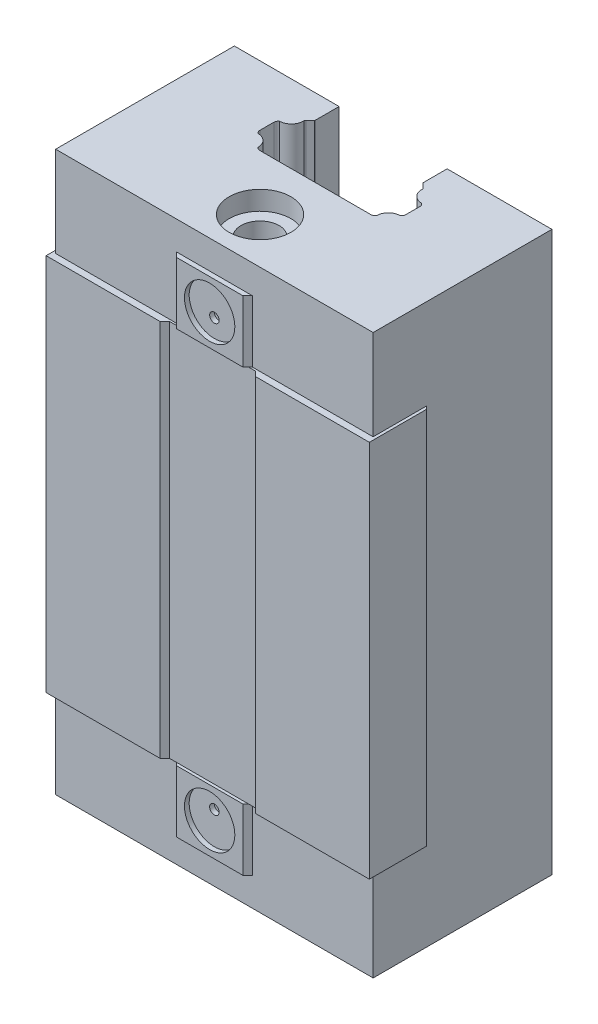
from build123d import *
from build123d.topology import SkipClean

# Parameters (mm, degrees)
SKETCH_1_W                     = 34
SKETCH_1_H                     = 39.8
EXTRUDE_1_DEPTH                = 19.5
SKETCH_2_W                     = 0.3
SKETCH_2_H                     = 13.5
CUT_EXTRUDE_1_DEPTH            = 77.88979114
SKETCH_3_W                     = 33.4
SKETCH_3_H                     = 18.8
EXTRUDE_2_DEPTH                = 8.5
SKETCH_4_W                     = 33.4
SKETCH_4_H                     = 18.8
EXTRUDE_3_DEPTH                = 8.5
SKETCH_5_W                     = 9
SKETCH_5_H                     = 0.5
CUT_EXTRUDE_2_DEPTH            = 82.614275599
SKETCH_6_W                     = 8
SKETCH_6_H                     = 6.5
EXTRUDE_4_DEPTH                = 0.2
SKETCH_7_W                     = 8
SKETCH_7_H                     = 6.5
EXTRUDE_5_DEPTH                = 0.3
SKETCH_8_W                     = 8
SKETCH_8_H                     = 6.5
EXTRUDE_6_DEPTH                = 0.2
SKETCH_9_W                     = 8
SKETCH_9_H                     = 6.5
EXTRUDE_7_DEPTH                = 0.3
CUT_EXTRUDE_3_DEPTH            = 87.915130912
DRAFT_1_ANGLE                  = 45
DRAFT_2_ANGLE                  = 45
DRAFT_3_ANGLE                  = 45
DRAFT_4_ANGLE                  = 45
HOLE_WIZARD_M3_5_1_D           = 4
HOLE_WIZARD_M3_5_1_DEPTH       = 5.4
HOLE_WIZARD_M3_5_1_CBORE_D     = 6.5
HOLE_WIZARD_M3_5_1_CBORE_DEPTH = 1
HOLE_WIZARD_M3_5_2_D           = 4
HOLE_WIZARD_M3_5_2_DEPTH       = 5.4
HOLE_WIZARD_M3_5_2_CBORE_D     = 6.5
HOLE_WIZARD_M3_5_2_CBORE_DEPTH = 1
HOLE_WIZARD_5_3_5_3_1_D        = 5.3
HOLE_WIZARD_5_3_5_3_1_DEPTH    = 0.5
HOLE_WIZARD_1_0_1_1_D          = 1
HOLE_WIZARD_1_0_1_1_DEPTH      = 0.5
FILLET_1_R                     = 0.12
SKETCH_25_W                    = 13.5
SKETCH_25_H                    = 39.8
CUT_EXTRUDE_4_DEPTH            = 0.3
EXTRUDE_START                  = 1
SKETCH_26_R                    = 3.25
EXTRUDE_8_DEPTH                = 1
SKETCH_27_R                    = 3.25
EXTRUDE_9_DEPTH                = 1


with BuildPart() as part:
    # Sketch 1 → Extrude 1 (new body)
    with BuildSketch(Plane(origin=(0, 0, 2.5), x_dir=(-1, 0, 0), z_dir=(0, 0, -1))):
        with Locations((-44.999999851, 136)):
            Rectangle(SKETCH_1_W, SKETCH_1_H)
    extrude(amount=-EXTRUDE_1_DEPTH)

    # Sketch 2 → Cut-Extrude 1 (cut, through all)
    with BuildSketch(Plane(origin=(0, 155.9, 0), x_dir=(-1, 0, 0), z_dir=(0, 1, 0))):
        with Locations((-61.849999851, 9.25)):
            Rectangle(SKETCH_2_W, SKETCH_2_H)
    extrude(amount=-CUT_EXTRUDE_1_DEPTH, mode=Mode.SUBTRACT)

    # Sketch 3 → Extrude 2 (add)
    with BuildSketch(Plane(origin=(0, 155.9, 0), x_dir=(-1, 0, 0), z_dir=(0, 1, 0))):
        with Locations((-44.999999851, 11.9)):
            Rectangle(SKETCH_3_W, SKETCH_3_H)
    extrude(amount=EXTRUDE_2_DEPTH)

    # Sketch 4 → Extrude 3 (add)
    with BuildSketch(Plane.XZ.offset(-116.1)):
        with Locations((44.999999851, 11.9)):
            Rectangle(SKETCH_4_W, SKETCH_4_H)
    extrude(amount=EXTRUDE_3_DEPTH)

    # Sketch 5 → Cut-Extrude 2 (cut, through all)
    with BuildSketch(Plane(origin=(0, 155.9, 0), x_dir=(-1, 0, 0), z_dir=(0, 1, 0))):
        with Locations((-44.999999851, 21.75)):
            Rectangle(SKETCH_5_W, SKETCH_5_H)
    extrude(amount=-CUT_EXTRUDE_2_DEPTH, mode=Mode.SUBTRACT)

    # Sketch 6 → Extrude 4 (add)
    with BuildSketch(Plane.XY.offset(21.3)):
        with Locations((44.999999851, 159.15)):
            Rectangle(SKETCH_6_W, SKETCH_6_H)
    extrude(amount=EXTRUDE_4_DEPTH)

    # Sketch 7 → Extrude 5 (add)
    with BuildSketch(Plane.XY.offset(21.5)):
        with Locations((44.999999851, 159.15)):
            Rectangle(SKETCH_7_W, SKETCH_7_H)
    extrude(amount=EXTRUDE_5_DEPTH)

    # Sketch 8 → Extrude 6 (add)
    with BuildSketch(Plane.XY.offset(21.3)):
        with Locations((44.999999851, 112.85)):
            Rectangle(SKETCH_8_W, SKETCH_8_H)
    extrude(amount=EXTRUDE_6_DEPTH)

    # Sketch 9 → Extrude 7 (add)
    with BuildSketch(Plane.XY.offset(21.5)):
        with Locations((44.999999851, 112.85)):
            Rectangle(SKETCH_9_W, SKETCH_9_H)
    extrude(amount=EXTRUDE_7_DEPTH)

    # Sketch 10 → Cut-Extrude 3 (cut, through all)
    with BuildSketch(Plane.XZ.offset(-107.6)):
        with BuildLine():
            Line((50.679999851, 2.5), (50.679999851, 5.031660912))
            Line((50.679999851, 5.031660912), (51.146433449, 5.498096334))
            ThreePointArc((51.146433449, 5.498096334), (51.194720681, 5.554506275), (51.233729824, 5.617688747))
            ThreePointArc((51.233729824, 5.617688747), (51.555700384, 6.562594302), (52.466836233, 6.97044601))
            ThreePointArc((52.466836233, 6.97044601), (52.623368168, 7.143258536), (52.679999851, 7.369442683))
            Line((52.679999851, 7.369442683), (52.679999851, 8.830565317))
            ThreePointArc((52.679999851, 8.830565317), (52.623368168, 9.056749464), (52.466836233, 9.22956199))
            ThreePointArc((52.466836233, 9.22956199), (51.595610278, 9.595614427), (51.229557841, 10.466840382))
            ThreePointArc((51.229557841, 10.466840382), (51.056745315, 10.623372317), (50.830561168, 10.680004))
            Line((50.830561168, 10.680004), (39.169438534, 10.680004))
            ThreePointArc((39.169438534, 10.680004), (38.943254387, 10.623372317), (38.770441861, 10.466840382))
            ThreePointArc((38.770441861, 10.466840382), (38.404389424, 9.595614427), (37.533163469, 9.22956199))
            ThreePointArc((37.533163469, 9.22956199), (37.376631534, 9.056749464), (37.319999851, 8.830565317))
            Line((37.319999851, 8.830565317), (37.319999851, 7.369442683))
            ThreePointArc((37.319999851, 7.369442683), (37.376631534, 7.143258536), (37.533163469, 6.97044601))
            ThreePointArc((37.533163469, 6.97044601), (38.444299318, 6.562594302), (38.766269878, 5.617688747))
            ThreePointArc((38.766269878, 5.617688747), (38.805279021, 5.554506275), (38.853566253, 5.498096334))
            Line((38.853566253, 5.498096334), (39.319999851, 5.031660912))
            Line((39.319999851, 5.031660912), (39.319999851, 2.5))
            Line((39.319999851, 2.5), (50.679999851, 2.5))
        make_face()
    extrude(amount=-CUT_EXTRUDE_3_DEPTH, mode=Mode.SUBTRACT)

    # Draft 1
    draft_1_faces = [part.faces().sort_by_distance(p)[0] for p in [
        (61.849999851, 136, 16),
    ]]
    draft(draft_1_faces, Plane(origin=(61.999999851, 155.9, 22), x_dir=(0, 0, 1), z_dir=(1, 0, 0)), DRAFT_1_ANGLE)

    # Draft 2
    draft_2_faces = [part.faces().sort_by_distance(p)[0] for p in [
        (48.999999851, 112.85, 21.55),
        (40.999999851, 112.85, 21.55),
    ]]
    draft(draft_2_faces, Plane(origin=(28.299999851, 107.6, 21.3), x_dir=(1, 0, 0), z_dir=(0, 0, 1)), DRAFT_2_ANGLE)

    # Draft 3
    draft_3_faces = [part.faces().sort_by_distance(p)[0] for p in [
        (48.999999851, 159.15, 21.55),
        (40.999999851, 159.15, 21.55),
    ]]
    draft(draft_3_faces, Plane(origin=(61.699999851, 164.4, 21.3), x_dir=(1, 0, 0), z_dir=(0, 0, 1)), DRAFT_3_ANGLE)

    # Draft 4
    draft_4_faces = [part.faces().sort_by_distance(p)[0] for p in [
        (40.499999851, 136, 21.75),
        (49.499999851, 136, 21.75),
    ]]
    draft(draft_4_faces, Plane(origin=(49.499999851, 107.599975, 21.5), x_dir=(1, 0, 0), z_dir=(0, 0, 1)), DRAFT_4_ANGLE)

    # Hole Wizard M3.5 _1
    with Locations(Plane(origin=(0, 107.6, 0), x_dir=(-1, 0, 0), z_dir=(0, -1, 0))):
        with Locations((-44.999999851, -16.5)):
            CounterBoreHole(HOLE_WIZARD_M3_5_1_D / 2, HOLE_WIZARD_M3_5_1_CBORE_D / 2, HOLE_WIZARD_M3_5_1_CBORE_DEPTH, depth=HOLE_WIZARD_M3_5_1_DEPTH)

    # Hole Wizard M3.5 _2
    with Locations(Plane(origin=(0, 164.4, 0), x_dir=(1, 0, 0), z_dir=(0, 1, 0))):
        with Locations((44.999999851, -16.5)):
            CounterBoreHole(HOLE_WIZARD_M3_5_2_D / 2, HOLE_WIZARD_M3_5_2_CBORE_D / 2, HOLE_WIZARD_M3_5_2_CBORE_DEPTH, depth=HOLE_WIZARD_M3_5_2_DEPTH)

    # Hole Wizard 5.3 _5.3_ _1
    with Locations(Plane.XY.offset(21.8)):
        with Locations((44.999999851, 159.15), (44.999999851, 112.85)):
            Hole(HOLE_WIZARD_5_3_5_3_1_D / 2, depth=HOLE_WIZARD_5_3_5_3_1_DEPTH)

    # Hole Wizard 1.0 _1_ _1
    with Locations(Plane.XY.offset(21.3)):
        with Locations((44.999999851, 158.4), (44.999999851, 113.6)):
            Hole(HOLE_WIZARD_1_0_1_1_D / 2, depth=HOLE_WIZARD_1_0_1_1_DEPTH)

    # Fillet 1
    fillet_1_edges = [part.edges().sort_by_distance(p)[0] for p in [
        (39.319999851, 136, 5.031660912),
        (50.679999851, 136, 5.031660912),
    ]]
    fillet(fillet_1_edges, radius=FILLET_1_R)

    # Sketch 25 → Cut-Extrude 4 (cut)
    with BuildSketch(Plane.ZY.offset(-27.999999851)):
        with Locations((9.25, 136)):
            Rectangle(SKETCH_25_W, SKETCH_25_H)
    extrude(amount=-CUT_EXTRUDE_4_DEPTH, mode=Mode.SUBTRACT)

    # Sketch 26 → Extrude 8 (add)
    with BuildSketch(Plane.XZ.offset(-107.6).offset(EXTRUDE_START)):
        with BuildLine():
            Line((39.319999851, 2.5), (39.319999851, 4.981955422))
            ThreePointArc((39.319999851, 4.981955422), (39.31086544, 5.027877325), (39.284852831, 5.066808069))
            Line((39.284852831, 5.066808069), (38.853566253, 5.498096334))
            ThreePointArc((38.853566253, 5.498096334), (38.805279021, 5.554506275), (38.766269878, 5.617688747))
            ThreePointArc((38.766269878, 5.617688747), (38.444299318, 6.562594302), (37.533163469, 6.97044601))
            ThreePointArc((37.533163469, 6.97044601), (37.376631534, 7.143258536), (37.319999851, 7.369442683))
            Line((37.319999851, 7.369442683), (37.319999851, 8.830565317))
            ThreePointArc((37.319999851, 8.830565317), (37.376631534, 9.056749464), (37.533163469, 9.22956199))
            ThreePointArc((37.533163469, 9.22956199), (38.404389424, 9.595614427), (38.770441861, 10.466840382))
            ThreePointArc((38.770441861, 10.466840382), (38.943254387, 10.623372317), (39.169438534, 10.680004))
            Line((39.169438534, 10.680004), (50.830561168, 10.680004))
            ThreePointArc((50.830561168, 10.680004), (51.056745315, 10.623372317), (51.229557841, 10.466840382))
            ThreePointArc((51.229557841, 10.466840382), (51.595610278, 9.595614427), (52.466836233, 9.22956199))
            ThreePointArc((52.466836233, 9.22956199), (52.623368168, 9.056749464), (52.679999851, 8.830565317))
            Line((52.679999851, 8.830565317), (52.679999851, 7.369442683))
            ThreePointArc((52.679999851, 7.369442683), (52.623368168, 7.143258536), (52.466836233, 6.97044601))
            ThreePointArc((52.466836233, 6.97044601), (51.555700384, 6.562594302), (51.233729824, 5.617688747))
            ThreePointArc((51.233729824, 5.617688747), (51.194720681, 5.554506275), (51.146433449, 5.498096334))
            Line((51.146433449, 5.498096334), (50.715146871, 5.066808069))
            ThreePointArc((50.715146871, 5.066808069), (50.689134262, 5.027877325), (50.679999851, 4.981955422))
            Line((50.679999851, 4.981955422), (50.679999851, 2.5))
            Line((50.679999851, 2.5), (61.699999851, 2.5))
            Line((61.699999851, 2.5), (61.699999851, 21.3))
            Line((61.699999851, 21.3), (28.299999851, 21.3))
            Line((28.299999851, 21.3), (28.299999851, 2.5))
            Line((28.299999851, 2.5), (39.319999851, 2.5))
        make_face()
        with Locations(Location((44.999999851, 16.5, 0), (0, 0, 90))):
            Circle(SKETCH_26_R, mode=Mode.SUBTRACT)
    extrude(amount=-EXTRUDE_8_DEPTH)

    # Sketch 27 → Extrude 9 (add)
    with SkipClean():  # the faces are left unmerged after this step: merging them gives an invalid solid
        with BuildSketch(Plane(origin=(0, 164.4, 0), x_dir=(1, 0, 0), z_dir=(0, 1, 0))):
            with BuildLine():
                Line((38.853566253, -5.498096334), (39.284852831, -5.066808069))
                ThreePointArc((39.284852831, -5.066808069), (39.31086544, -5.027877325), (39.319999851, -4.981955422))
                Line((39.319999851, -4.981955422), (39.319999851, -2.5))
                Line((39.319999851, -2.5), (28.299999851, -2.5))
                Line((28.299999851, -2.5), (28.299999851, -21.3))
                Line((28.299999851, -21.3), (61.699999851, -21.3))
                Line((61.699999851, -21.3), (61.699999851, -2.5))
                Line((61.699999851, -2.5), (50.679999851, -2.5))
                Line((50.679999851, -2.5), (50.679999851, -4.981955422))
                ThreePointArc((50.679999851, -4.981955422), (50.689134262, -5.027877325), (50.715146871, -5.066808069))
                Line((50.715146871, -5.066808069), (51.146433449, -5.498096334))
                ThreePointArc((51.146433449, -5.498096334), (51.194720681, -5.554506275), (51.233729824, -5.617688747))
                ThreePointArc((51.233729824, -5.617688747), (51.555700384, -6.562594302), (52.466836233, -6.97044601))
                ThreePointArc((52.466836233, -6.97044601), (52.623368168, -7.143258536), (52.679999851, -7.369442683))
                Line((52.679999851, -7.369442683), (52.679999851, -8.830565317))
                ThreePointArc((52.679999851, -8.830565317), (52.623368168, -9.056749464), (52.466836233, -9.22956199))
                ThreePointArc((52.466836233, -9.22956199), (51.595610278, -9.595614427), (51.229557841, -10.466840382))
                ThreePointArc((51.229557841, -10.466840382), (51.056745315, -10.623372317), (50.830561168, -10.680004))
                Line((50.830561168, -10.680004), (39.169438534, -10.680004))
                ThreePointArc((39.169438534, -10.680004), (38.943254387, -10.623372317), (38.770441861, -10.466840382))
                ThreePointArc((38.770441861, -10.466840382), (38.404389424, -9.595614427), (37.533163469, -9.22956199))
                ThreePointArc((37.533163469, -9.22956199), (37.376631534, -9.056749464), (37.319999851, -8.830565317))
                Line((37.319999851, -8.830565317), (37.319999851, -7.369442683))
                ThreePointArc((37.319999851, -7.369442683), (37.376631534, -7.143258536), (37.533163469, -6.97044601))
                ThreePointArc((37.533163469, -6.97044601), (38.444299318, -6.562594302), (38.766269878, -5.617688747))
                ThreePointArc((38.766269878, -5.617688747), (38.805279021, -5.554506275), (38.853566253, -5.498096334))
            make_face()
            with Locations(Location((44.999999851, -16.5, 0), (0, 0, 90))):
                Circle(SKETCH_27_R, mode=Mode.SUBTRACT)
        extrude(amount=EXTRUDE_9_DEPTH)


solid = part.part
